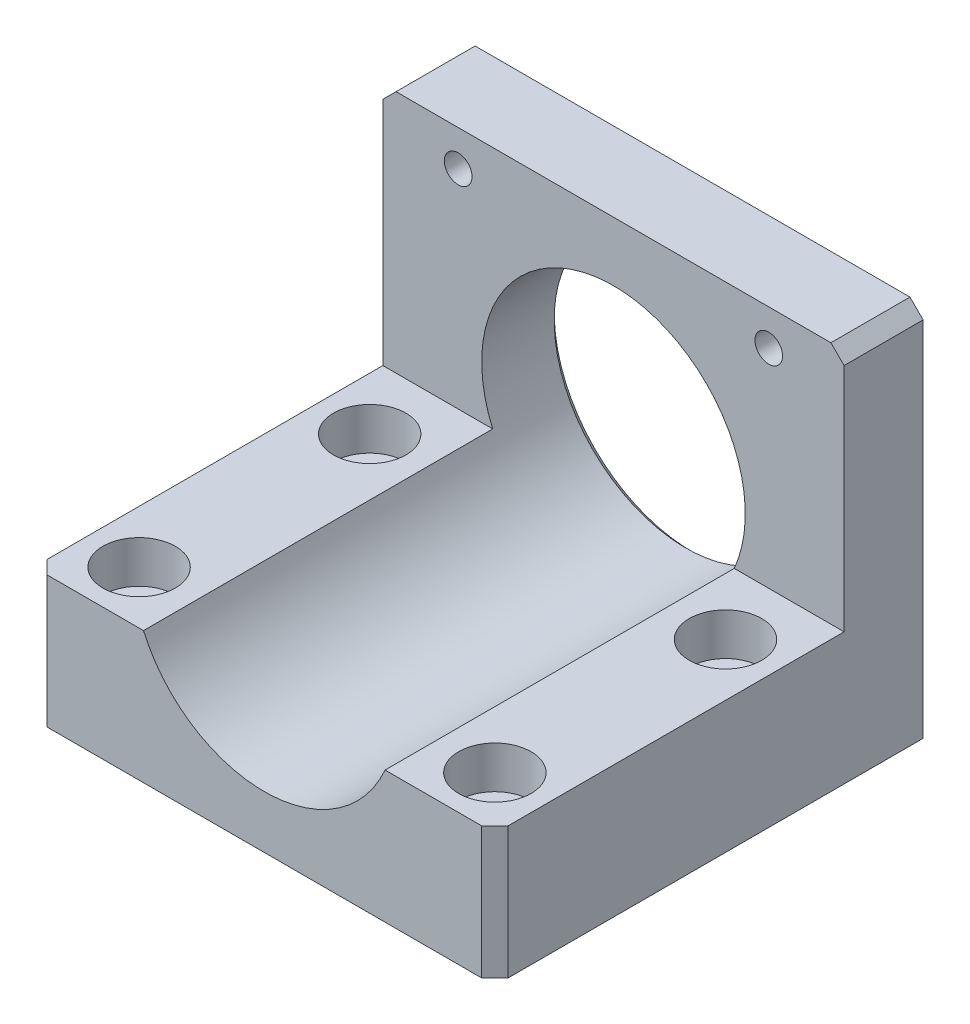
ISO-10303-21;
HEADER;
FILE_DESCRIPTION(('STEP AP214'),'2;1');
FILE_NAME('part.step','',(''),(''),'','','');
FILE_SCHEMA(('AUTOMOTIVE_DESIGN { 1 0 10303 214 1 1 1 1 }'));
ENDSEC;
DATA;
#1=APPLICATION_CONTEXT('core data for automotive mechanical design processes');
#2=APPLICATION_PROTOCOL_DEFINITION('international standard','automotive_design',2000,#1);
#3=PRODUCT_CONTEXT('',#1,'mechanical');
#4=PRODUCT('Part','Part','',(#3));
#5=PRODUCT_RELATED_PRODUCT_CATEGORY('part','',(#4));
#6=PRODUCT_DEFINITION_FORMATION('','',#4);
#7=PRODUCT_DEFINITION_CONTEXT('part definition',#1,'design');
#8=PRODUCT_DEFINITION('design','',#6,#7);
#9=PRODUCT_DEFINITION_SHAPE('','',#8);
#10=(LENGTH_UNIT() NAMED_UNIT(*) SI_UNIT(.MILLI.,.METRE.));
#11=(NAMED_UNIT(*) PLANE_ANGLE_UNIT() SI_UNIT($,.RADIAN.));
#12=(NAMED_UNIT(*) SI_UNIT($,.STERADIAN.) SOLID_ANGLE_UNIT());
#13=UNCERTAINTY_MEASURE_WITH_UNIT(LENGTH_MEASURE(1.E-05),#10,'distance_accuracy_value','');
#14=(GEOMETRIC_REPRESENTATION_CONTEXT(3) GLOBAL_UNCERTAINTY_ASSIGNED_CONTEXT((#13)) GLOBAL_UNIT_ASSIGNED_CONTEXT((#10,
#11,#12)) REPRESENTATION_CONTEXT('',''));
#15=CARTESIAN_POINT('',(0.,0.,0.));
#16=DIRECTION('',(0.,0.,1.));
#17=DIRECTION('',(1.,0.,0.));
#18=AXIS2_PLACEMENT_3D('',#15,#16,#17);
#19=CARTESIAN_POINT('',(0.,0.,65.));
#20=DIRECTION('',(0.,0.,1.));
#21=DIRECTION('',(1.,0.,0.));
#22=AXIS2_PLACEMENT_3D('',#19,#20,#21);
#23=PLANE('',#22);
#24=DIRECTION('',(1.,0.,0.));
#25=VECTOR('',#24,1.);
#26=CARTESIAN_POINT('',(-35.,-28.,65.));
#27=LINE('',#26,#25);
#28=CARTESIAN_POINT('',(-33.,-28.,65.));
#29=VERTEX_POINT('',#28);
#30=CARTESIAN_POINT('',(33.,-28.,65.));
#31=VERTEX_POINT('',#30);
#32=EDGE_CURVE('E236',#29,#31,#27,.T.);
#33=ORIENTED_EDGE('',*,*,#32,.T.);
#34=DIRECTION('',(0.,1.,0.));
#35=VECTOR('',#34,1.);
#36=CARTESIAN_POINT('',(33.,-8.00000000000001,65.));
#37=LINE('',#36,#35);
#38=CARTESIAN_POINT('',(33.,-8.00000000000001,65.));
#39=VERTEX_POINT('',#38);
#40=EDGE_CURVE('E261',#31,#39,#37,.T.);
#41=ORIENTED_EDGE('',*,*,#40,.T.);
#42=DIRECTION('',(1.,0.,0.));
#43=VECTOR('',#42,1.);
#44=CARTESIAN_POINT('',(-35.,-8.00000000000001,65.));
#45=LINE('',#44,#43);
#46=CARTESIAN_POINT('',(18.3303027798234,-8.00000000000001,65.));
#47=VERTEX_POINT('',#46);
#48=EDGE_CURVE('E208',#47,#39,#45,.T.);
#49=ORIENTED_EDGE('',*,*,#48,.F.);
#50=CARTESIAN_POINT('',(0.,0.,65.));
#51=DIRECTION('',(0.,0.,1.));
#52=DIRECTION('',(1.,0.,0.));
#53=AXIS2_PLACEMENT_3D('',#50,#51,#52);
#54=CIRCLE('',#53,20.);
#55=CARTESIAN_POINT('',(-18.3303027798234,-8.00000000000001,65.));
#56=VERTEX_POINT('',#55);
#57=EDGE_CURVE('E232',#56,#47,#54,.T.);
#58=ORIENTED_EDGE('',*,*,#57,.F.);
#59=CARTESIAN_POINT('',(-33.,-8.00000000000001,65.));
#60=VERTEX_POINT('',#59);
#61=EDGE_CURVE('E188',#60,#56,#45,.T.);
#62=ORIENTED_EDGE('',*,*,#61,.F.);
#63=DIRECTION('',(0.,-1.,0.));
#64=VECTOR('',#63,1.);
#65=CARTESIAN_POINT('',(-33.,-28.,65.));
#66=LINE('',#65,#64);
#67=EDGE_CURVE('E258',#60,#29,#66,.T.);
#68=ORIENTED_EDGE('',*,*,#67,.T.);
#69=EDGE_LOOP('',(#33,#41,#49,#58,#62,#68));
#70=FACE_BOUND('',#69,.T.);
#71=ADVANCED_FACE('F72',(#70),#23,.T.);
#72=CARTESIAN_POINT('',(0.,0.,0.));
#73=DIRECTION('',(0.,0.,1.));
#74=DIRECTION('',(1.,0.,0.));
#75=AXIS2_PLACEMENT_3D('',#72,#73,#74);
#76=PLANE('',#75);
#77=CARTESIAN_POINT('',(0.,0.,0.));
#78=DIRECTION('',(0.,0.,1.));
#79=DIRECTION('',(1.,0.,0.));
#80=AXIS2_PLACEMENT_3D('',#77,#78,#79);
#81=CIRCLE('',#80,21.);
#82=CARTESIAN_POINT('',(21.,0.,0.));
#83=VERTEX_POINT('',#82);
#84=EDGE_CURVE('E80',#83,#83,#81,.T.);
#85=ORIENTED_EDGE('',*,*,#84,.T.);
#86=EDGE_LOOP('',(#85));
#87=FACE_BOUND('',#86,.T.);
#88=CARTESIAN_POINT('',(23.57,23.57,0.));
#89=DIRECTION('',(0.,0.,-1.));
#90=DIRECTION('',(-1.,0.,0.));
#91=AXIS2_PLACEMENT_3D('',#88,#89,#90);
#92=CIRCLE('',#91,2.09999999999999);
#93=CARTESIAN_POINT('',(21.47,23.57,0.));
#94=VERTEX_POINT('',#93);
#95=EDGE_CURVE('E214',#94,#94,#92,.T.);
#96=ORIENTED_EDGE('',*,*,#95,.F.);
#97=EDGE_LOOP('',(#96));
#98=FACE_BOUND('',#97,.T.);
#99=CARTESIAN_POINT('',(-23.57,23.57,0.));
#100=DIRECTION('',(0.,0.,-1.));
#101=DIRECTION('',(-1.,0.,0.));
#102=AXIS2_PLACEMENT_3D('',#99,#100,#101);
#103=CIRCLE('',#102,2.09999999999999);
#104=CARTESIAN_POINT('',(-25.67,23.57,0.));
#105=VERTEX_POINT('',#104);
#106=EDGE_CURVE('E217',#105,#105,#103,.T.);
#107=ORIENTED_EDGE('',*,*,#106,.F.);
#108=EDGE_LOOP('',(#107));
#109=FACE_BOUND('',#108,.T.);
#110=CARTESIAN_POINT('',(-23.57,-23.57,0.));
#111=DIRECTION('',(0.,0.,-1.));
#112=DIRECTION('',(-1.,0.,0.));
#113=AXIS2_PLACEMENT_3D('',#110,#111,#112);
#114=CIRCLE('',#113,2.09999999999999);
#115=CARTESIAN_POINT('',(-25.67,-23.57,0.));
#116=VERTEX_POINT('',#115);
#117=EDGE_CURVE('E220',#116,#116,#114,.T.);
#118=ORIENTED_EDGE('',*,*,#117,.F.);
#119=EDGE_LOOP('',(#118));
#120=FACE_BOUND('',#119,.T.);
#121=CARTESIAN_POINT('',(23.57,-23.57,0.));
#122=DIRECTION('',(0.,0.,-1.));
#123=DIRECTION('',(-1.,0.,0.));
#124=AXIS2_PLACEMENT_3D('',#121,#122,#123);
#125=CIRCLE('',#124,2.09999999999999);
#126=CARTESIAN_POINT('',(21.47,-23.57,0.));
#127=VERTEX_POINT('',#126);
#128=EDGE_CURVE('E226',#127,#127,#125,.T.);
#129=ORIENTED_EDGE('',*,*,#128,.F.);
#130=EDGE_LOOP('',(#129));
#131=FACE_BOUND('',#130,.T.);
#132=DIRECTION('',(0.,-1.,0.));
#133=VECTOR('',#132,1.);
#134=CARTESIAN_POINT('',(-35.,29.,0.));
#135=LINE('',#134,#133);
#136=CARTESIAN_POINT('',(-35.,27.,0.));
#137=VERTEX_POINT('',#136);
#138=CARTESIAN_POINT('',(-35.,-28.,0.));
#139=VERTEX_POINT('',#138);
#140=EDGE_CURVE('E235',#137,#139,#135,.T.);
#141=ORIENTED_EDGE('',*,*,#140,.F.);
#142=DIRECTION('',(-0.707106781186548,-0.707106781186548,0.));
#143=VECTOR('',#142,1.);
#144=CARTESIAN_POINT('',(-35.,27.,0.));
#145=LINE('',#144,#143);
#146=CARTESIAN_POINT('',(-33.,29.,0.));
#147=VERTEX_POINT('',#146);
#148=EDGE_CURVE('E281',#137,#147,#145,.F.);
#149=ORIENTED_EDGE('',*,*,#148,.T.);
#150=DIRECTION('',(-1.,0.,0.));
#151=VECTOR('',#150,1.);
#152=CARTESIAN_POINT('',(-35.,29.,0.));
#153=LINE('',#152,#151);
#154=CARTESIAN_POINT('',(33.,29.,0.));
#155=VERTEX_POINT('',#154);
#156=EDGE_CURVE('E240',#155,#147,#153,.T.);
#157=ORIENTED_EDGE('',*,*,#156,.F.);
#158=DIRECTION('',(-0.707106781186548,0.707106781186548,0.));
#159=VECTOR('',#158,1.);
#160=CARTESIAN_POINT('',(33.,29.,0.));
#161=LINE('',#160,#159);
#162=CARTESIAN_POINT('',(35.,27.,0.));
#163=VERTEX_POINT('',#162);
#164=EDGE_CURVE('E279',#155,#163,#161,.F.);
#165=ORIENTED_EDGE('',*,*,#164,.T.);
#166=DIRECTION('',(0.,1.,0.));
#167=VECTOR('',#166,1.);
#168=CARTESIAN_POINT('',(35.,29.,0.));
#169=LINE('',#168,#167);
#170=CARTESIAN_POINT('',(35.,-28.,0.));
#171=VERTEX_POINT('',#170);
#172=EDGE_CURVE('E245',#171,#163,#169,.T.);
#173=ORIENTED_EDGE('',*,*,#172,.F.);
#174=DIRECTION('',(1.,0.,0.));
#175=VECTOR('',#174,1.);
#176=CARTESIAN_POINT('',(-35.,-28.,0.));
#177=LINE('',#176,#175);
#178=EDGE_CURVE('E242',#139,#171,#177,.T.);
#179=ORIENTED_EDGE('',*,*,#178,.F.);
#180=EDGE_LOOP('',(#141,#149,#157,#165,#173,#179));
#181=FACE_BOUND('',#180,.T.);
#182=ADVANCED_FACE('F292',(#87,#98,#109,#120,#131,#181),#76,.F.);
#183=CARTESIAN_POINT('',(-35.,29.,65.));
#184=DIRECTION('',(1.,0.,0.));
#185=DIRECTION('',(0.,1.,0.));
#186=AXIS2_PLACEMENT_3D('',#183,#184,#185);
#187=PLANE('',#186);
#188=DIRECTION('',(0.,0.,-1.));
#189=VECTOR('',#188,1.);
#190=CARTESIAN_POINT('',(-35.,-28.,65.));
#191=LINE('',#190,#189);
#192=CARTESIAN_POINT('',(-35.,-28.,63.));
#193=VERTEX_POINT('',#192);
#194=EDGE_CURVE('E249',#193,#139,#191,.T.);
#195=ORIENTED_EDGE('',*,*,#194,.F.);
#196=DIRECTION('',(0.,1.,0.));
#197=VECTOR('',#196,1.);
#198=CARTESIAN_POINT('',(-35.,-8.00000000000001,63.));
#199=LINE('',#198,#197);
#200=CARTESIAN_POINT('',(-35.,-8.00000000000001,63.));
#201=VERTEX_POINT('',#200);
#202=EDGE_CURVE('E275',#193,#201,#199,.T.);
#203=ORIENTED_EDGE('',*,*,#202,.T.);
#204=DIRECTION('',(0.,0.,-1.));
#205=VECTOR('',#204,1.);
#206=CARTESIAN_POINT('',(-35.,-8.,12.));
#207=LINE('',#206,#205);
#208=CARTESIAN_POINT('',(-35.,-8.,12.));
#209=VERTEX_POINT('',#208);
#210=EDGE_CURVE('E203',#201,#209,#207,.T.);
#211=ORIENTED_EDGE('',*,*,#210,.T.);
#212=DIRECTION('',(0.,1.,0.));
#213=VECTOR('',#212,1.);
#214=CARTESIAN_POINT('',(-35.,29.,12.));
#215=LINE('',#214,#213);
#216=CARTESIAN_POINT('',(-35.,27.,12.));
#217=VERTEX_POINT('',#216);
#218=EDGE_CURVE('E178',#209,#217,#215,.T.);
#219=ORIENTED_EDGE('',*,*,#218,.T.);
#220=DIRECTION('',(0.,0.,-1.));
#221=VECTOR('',#220,1.);
#222=CARTESIAN_POINT('',(-35.,27.,65.));
#223=LINE('',#222,#221);
#224=EDGE_CURVE('E272',#217,#137,#223,.T.);
#225=ORIENTED_EDGE('',*,*,#224,.T.);
#226=ORIENTED_EDGE('',*,*,#140,.T.);
#227=EDGE_LOOP('',(#195,#203,#211,#219,#225,#226));
#228=FACE_BOUND('',#227,.T.);
#229=ADVANCED_FACE('F311',(#228),#187,.F.);
#230=CARTESIAN_POINT('',(-35.,-28.,65.));
#231=DIRECTION('',(0.,1.,0.));
#232=DIRECTION('',(-1.,0.,0.));
#233=AXIS2_PLACEMENT_3D('',#230,#231,#232);
#234=PLANE('',#233);
#235=CARTESIAN_POINT('',(-27.,-28.,22.));
#236=DIRECTION('',(0.,1.,0.));
#237=DIRECTION('',(0.,0.,1.));
#238=AXIS2_PLACEMENT_3D('',#235,#236,#237);
#239=CIRCLE('',#238,3.2);
#240=CARTESIAN_POINT('',(-27.,-28.,25.2));
#241=VERTEX_POINT('',#240);
#242=EDGE_CURVE('E467',#241,#241,#239,.T.);
#243=ORIENTED_EDGE('',*,*,#242,.T.);
#244=EDGE_LOOP('',(#243));
#245=FACE_BOUND('',#244,.T.);
#246=CARTESIAN_POINT('',(-27.,-28.,57.));
#247=DIRECTION('',(0.,1.,0.));
#248=DIRECTION('',(0.,0.,1.));
#249=AXIS2_PLACEMENT_3D('',#246,#247,#248);
#250=CIRCLE('',#249,3.2);
#251=CARTESIAN_POINT('',(-27.,-28.,60.2));
#252=VERTEX_POINT('',#251);
#253=EDGE_CURVE('E479',#252,#252,#250,.T.);
#254=ORIENTED_EDGE('',*,*,#253,.T.);
#255=EDGE_LOOP('',(#254));
#256=FACE_BOUND('',#255,.T.);
#257=CARTESIAN_POINT('',(27.,-28.,57.));
#258=DIRECTION('',(0.,1.,0.));
#259=DIRECTION('',(0.,0.,1.));
#260=AXIS2_PLACEMENT_3D('',#257,#258,#259);
#261=CIRCLE('',#260,3.2);
#262=CARTESIAN_POINT('',(27.,-28.,60.2));
#263=VERTEX_POINT('',#262);
#264=EDGE_CURVE('E491',#263,#263,#261,.T.);
#265=ORIENTED_EDGE('',*,*,#264,.T.);
#266=EDGE_LOOP('',(#265));
#267=FACE_BOUND('',#266,.T.);
#268=CARTESIAN_POINT('',(27.,-28.,22.));
#269=DIRECTION('',(0.,1.,0.));
#270=DIRECTION('',(0.,0.,1.));
#271=AXIS2_PLACEMENT_3D('',#268,#269,#270);
#272=CIRCLE('',#271,3.2);
#273=CARTESIAN_POINT('',(27.,-28.,25.2));
#274=VERTEX_POINT('',#273);
#275=EDGE_CURVE('E194',#274,#274,#272,.T.);
#276=ORIENTED_EDGE('',*,*,#275,.T.);
#277=EDGE_LOOP('',(#276));
#278=FACE_BOUND('',#277,.T.);
#279=DIRECTION('',(0.,0.,-1.));
#280=VECTOR('',#279,1.);
#281=CARTESIAN_POINT('',(35.,-28.,65.));
#282=LINE('',#281,#280);
#283=CARTESIAN_POINT('',(35.,-28.,63.));
#284=VERTEX_POINT('',#283);
#285=EDGE_CURVE('E239',#284,#171,#282,.T.);
#286=ORIENTED_EDGE('',*,*,#285,.F.);
#287=DIRECTION('',(-0.707106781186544,0.,0.707106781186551));
#288=VECTOR('',#287,1.);
#289=CARTESIAN_POINT('',(33.,-28.,65.));
#290=LINE('',#289,#288);
#291=EDGE_CURVE('E270',#284,#31,#290,.T.);
#292=ORIENTED_EDGE('',*,*,#291,.T.);
#293=ORIENTED_EDGE('',*,*,#32,.F.);
#294=DIRECTION('',(-0.707106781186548,0.,-0.707106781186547));
#295=VECTOR('',#294,1.);
#296=CARTESIAN_POINT('',(-33.,-28.,65.));
#297=LINE('',#296,#295);
#298=EDGE_CURVE('E268',#29,#193,#297,.T.);
#299=ORIENTED_EDGE('',*,*,#298,.T.);
#300=ORIENTED_EDGE('',*,*,#194,.T.);
#301=ORIENTED_EDGE('',*,*,#178,.T.);
#302=EDGE_LOOP('',(#286,#292,#293,#299,#300,#301));
#303=FACE_BOUND('',#302,.T.);
#304=ADVANCED_FACE('F322',(#245,#256,#267,#278,#303),#234,.F.);
#305=CARTESIAN_POINT('',(35.,29.,65.));
#306=DIRECTION('',(-1.,0.,0.));
#307=DIRECTION('',(0.,-1.,0.));
#308=AXIS2_PLACEMENT_3D('',#305,#306,#307);
#309=PLANE('',#308);
#310=DIRECTION('',(0.,0.,-1.));
#311=VECTOR('',#310,1.);
#312=CARTESIAN_POINT('',(35.,-8.,12.));
#313=LINE('',#312,#311);
#314=CARTESIAN_POINT('',(35.,-8.00000000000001,63.));
#315=VERTEX_POINT('',#314);
#316=CARTESIAN_POINT('',(35.,-8.,12.));
#317=VERTEX_POINT('',#316);
#318=EDGE_CURVE('E168',#315,#317,#313,.T.);
#319=ORIENTED_EDGE('',*,*,#318,.F.);
#320=DIRECTION('',(0.,-1.,0.));
#321=VECTOR('',#320,1.);
#322=CARTESIAN_POINT('',(35.,-28.,63.));
#323=LINE('',#322,#321);
#324=EDGE_CURVE('E266',#315,#284,#323,.T.);
#325=ORIENTED_EDGE('',*,*,#324,.T.);
#326=ORIENTED_EDGE('',*,*,#285,.T.);
#327=ORIENTED_EDGE('',*,*,#172,.T.);
#328=DIRECTION('',(0.,0.,1.));
#329=VECTOR('',#328,1.);
#330=CARTESIAN_POINT('',(35.,27.,65.));
#331=LINE('',#330,#329);
#332=CARTESIAN_POINT('',(35.,27.,12.));
#333=VERTEX_POINT('',#332);
#334=EDGE_CURVE('E193',#163,#333,#331,.T.);
#335=ORIENTED_EDGE('',*,*,#334,.T.);
#336=DIRECTION('',(0.,1.,0.));
#337=VECTOR('',#336,1.);
#338=CARTESIAN_POINT('',(35.,29.,12.));
#339=LINE('',#338,#337);
#340=EDGE_CURVE('E179',#317,#333,#339,.T.);
#341=ORIENTED_EDGE('',*,*,#340,.F.);
#342=EDGE_LOOP('',(#319,#325,#326,#327,#335,#341));
#343=FACE_BOUND('',#342,.T.);
#344=ADVANCED_FACE('F190',(#343),#309,.F.);
#345=CARTESIAN_POINT('',(-35.,29.,65.));
#346=DIRECTION('',(0.,-1.,0.));
#347=DIRECTION('',(1.,0.,0.));
#348=AXIS2_PLACEMENT_3D('',#345,#346,#347);
#349=PLANE('',#348);
#350=ORIENTED_EDGE('',*,*,#156,.T.);
#351=DIRECTION('',(0.,0.,1.));
#352=VECTOR('',#351,1.);
#353=CARTESIAN_POINT('',(-33.,29.,65.));
#354=LINE('',#353,#352);
#355=CARTESIAN_POINT('',(-33.,29.,12.));
#356=VERTEX_POINT('',#355);
#357=EDGE_CURVE('E94',#147,#356,#354,.T.);
#358=ORIENTED_EDGE('',*,*,#357,.T.);
#359=DIRECTION('',(1.,0.,0.));
#360=VECTOR('',#359,1.);
#361=CARTESIAN_POINT('',(-35.,29.,12.));
#362=LINE('',#361,#360);
#363=CARTESIAN_POINT('',(33.,29.,12.));
#364=VERTEX_POINT('',#363);
#365=EDGE_CURVE('E204',#356,#364,#362,.T.);
#366=ORIENTED_EDGE('',*,*,#365,.T.);
#367=DIRECTION('',(0.,0.,-1.));
#368=VECTOR('',#367,1.);
#369=CARTESIAN_POINT('',(33.,29.,65.));
#370=LINE('',#369,#368);
#371=EDGE_CURVE('E283',#364,#155,#370,.T.);
#372=ORIENTED_EDGE('',*,*,#371,.T.);
#373=EDGE_LOOP('',(#350,#358,#366,#372));
#374=FACE_BOUND('',#373,.T.);
#375=ADVANCED_FACE('F317',(#374),#349,.F.);
#376=CARTESIAN_POINT('',(0.,0.,65.));
#377=DIRECTION('',(0.,0.,-1.));
#378=DIRECTION('',(-1.,0.,0.));
#379=AXIS2_PLACEMENT_3D('',#376,#377,#378);
#380=CYLINDRICAL_SURFACE('',#379,20.);
#381=CARTESIAN_POINT('',(0.,0.,0.999999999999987));
#382=DIRECTION('',(0.,0.,1.));
#383=DIRECTION('',(1.,0.,0.));
#384=AXIS2_PLACEMENT_3D('',#381,#382,#383);
#385=CIRCLE('',#384,20.);
#386=CARTESIAN_POINT('',(20.,0.,0.999999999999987));
#387=VERTEX_POINT('',#386);
#388=EDGE_CURVE('E14',#387,#387,#385,.F.);
#389=ORIENTED_EDGE('',*,*,#388,.T.);
#390=EDGE_LOOP('',(#389));
#391=FACE_BOUND('',#390,.T.);
#392=DIRECTION('',(0.,0.,-1.));
#393=VECTOR('',#392,1.);
#394=CARTESIAN_POINT('',(-18.3303027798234,-8.00000000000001,65.));
#395=LINE('',#394,#393);
#396=CARTESIAN_POINT('',(-18.3303027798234,-8.,12.));
#397=VERTEX_POINT('',#396);
#398=EDGE_CURVE('E256',#56,#397,#395,.T.);
#399=ORIENTED_EDGE('',*,*,#398,.F.);
#400=ORIENTED_EDGE('',*,*,#57,.T.);
#401=DIRECTION('',(0.,0.,-1.));
#402=VECTOR('',#401,1.);
#403=CARTESIAN_POINT('',(18.3303027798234,-8.00000000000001,65.));
#404=LINE('',#403,#402);
#405=CARTESIAN_POINT('',(18.3303027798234,-8.00000000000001,12.));
#406=VERTEX_POINT('',#405);
#407=EDGE_CURVE('E252',#406,#47,#404,.F.);
#408=ORIENTED_EDGE('',*,*,#407,.F.);
#409=CARTESIAN_POINT('',(0.,0.,12.));
#410=DIRECTION('',(0.,0.,-1.));
#411=DIRECTION('',(0.,1.,0.));
#412=AXIS2_PLACEMENT_3D('',#409,#410,#411);
#413=CIRCLE('',#412,20.);
#414=EDGE_CURVE('E185',#397,#406,#413,.T.);
#415=ORIENTED_EDGE('',*,*,#414,.F.);
#416=EDGE_LOOP('',(#399,#400,#408,#415));
#417=FACE_BOUND('',#416,.T.);
#418=ADVANCED_FACE('F314',(#391,#417),#380,.F.);
#419=CARTESIAN_POINT('',(23.57,-23.57,14.));
#420=DIRECTION('',(0.,0.,-1.));
#421=DIRECTION('',(-1.,0.,0.));
#422=AXIS2_PLACEMENT_3D('',#419,#420,#421);
#423=CONICAL_SURFACE('',#422,2.1,1.02974425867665);
#424=CARTESIAN_POINT('',(23.57,-23.57,15.2618072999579));
#425=VERTEX_POINT('',#424);
#426=VERTEX_LOOP('',#425);
#427=FACE_BOUND('',#426,.T.);
#428=CARTESIAN_POINT('',(23.57,-23.57,14.));
#429=DIRECTION('',(0.,0.,-1.));
#430=DIRECTION('',(-1.,0.,0.));
#431=AXIS2_PLACEMENT_3D('',#428,#429,#430);
#432=CIRCLE('',#431,2.1);
#433=CARTESIAN_POINT('',(21.47,-23.57,14.));
#434=VERTEX_POINT('',#433);
#435=EDGE_CURVE('E229',#434,#434,#432,.T.);
#436=ORIENTED_EDGE('',*,*,#435,.T.);
#437=EDGE_LOOP('',(#436));
#438=FACE_BOUND('',#437,.T.);
#439=ADVANCED_FACE('F370',(#427,#438),#423,.F.);
#440=CARTESIAN_POINT('',(23.57,-23.57,0.));
#441=DIRECTION('',(0.,0.,-1.));
#442=DIRECTION('',(-1.,0.,0.));
#443=AXIS2_PLACEMENT_3D('',#440,#441,#442);
#444=CYLINDRICAL_SURFACE('',#443,2.09999999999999);
#445=ORIENTED_EDGE('',*,*,#435,.F.);
#446=EDGE_LOOP('',(#445));
#447=FACE_BOUND('',#446,.T.);
#448=ORIENTED_EDGE('',*,*,#128,.T.);
#449=EDGE_LOOP('',(#448));
#450=FACE_BOUND('',#449,.T.);
#451=ADVANCED_FACE('F375',(#447,#450),#444,.F.);
#452=CARTESIAN_POINT('',(-23.57,-23.57,14.));
#453=DIRECTION('',(0.,0.,-1.));
#454=DIRECTION('',(-1.,0.,0.));
#455=AXIS2_PLACEMENT_3D('',#452,#453,#454);
#456=CONICAL_SURFACE('',#455,2.1,1.02974425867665);
#457=CARTESIAN_POINT('',(-23.57,-23.57,15.2618072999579));
#458=VERTEX_POINT('',#457);
#459=VERTEX_LOOP('',#458);
#460=FACE_BOUND('',#459,.T.);
#461=CARTESIAN_POINT('',(-23.57,-23.57,14.));
#462=DIRECTION('',(0.,0.,-1.));
#463=DIRECTION('',(-1.,0.,0.));
#464=AXIS2_PLACEMENT_3D('',#461,#462,#463);
#465=CIRCLE('',#464,2.1);
#466=CARTESIAN_POINT('',(-25.67,-23.57,14.));
#467=VERTEX_POINT('',#466);
#468=EDGE_CURVE('E223',#467,#467,#465,.T.);
#469=ORIENTED_EDGE('',*,*,#468,.T.);
#470=EDGE_LOOP('',(#469));
#471=FACE_BOUND('',#470,.T.);
#472=ADVANCED_FACE('F380',(#460,#471),#456,.F.);
#473=CARTESIAN_POINT('',(-23.57,-23.57,0.));
#474=DIRECTION('',(0.,0.,-1.));
#475=DIRECTION('',(-1.,0.,0.));
#476=AXIS2_PLACEMENT_3D('',#473,#474,#475);
#477=CYLINDRICAL_SURFACE('',#476,2.09999999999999);
#478=ORIENTED_EDGE('',*,*,#468,.F.);
#479=EDGE_LOOP('',(#478));
#480=FACE_BOUND('',#479,.T.);
#481=ORIENTED_EDGE('',*,*,#117,.T.);
#482=EDGE_LOOP('',(#481));
#483=FACE_BOUND('',#482,.T.);
#484=ADVANCED_FACE('F387',(#480,#483),#477,.F.);
#485=CARTESIAN_POINT('',(-23.57,23.57,0.));
#486=DIRECTION('',(0.,0.,-1.));
#487=DIRECTION('',(-1.,0.,0.));
#488=AXIS2_PLACEMENT_3D('',#485,#486,#487);
#489=CYLINDRICAL_SURFACE('',#488,2.09999999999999);
#490=CARTESIAN_POINT('',(-23.57,23.57,12.));
#491=DIRECTION('',(0.,0.,-1.));
#492=DIRECTION('',(0.,1.,0.));
#493=AXIS2_PLACEMENT_3D('',#490,#491,#492);
#494=CIRCLE('',#493,2.09999999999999);
#495=CARTESIAN_POINT('',(-23.57,25.67,12.));
#496=VERTEX_POINT('',#495);
#497=EDGE_CURVE('E210',#496,#496,#494,.F.);
#498=ORIENTED_EDGE('',*,*,#497,.T.);
#499=EDGE_LOOP('',(#498));
#500=FACE_BOUND('',#499,.T.);
#501=ORIENTED_EDGE('',*,*,#106,.T.);
#502=EDGE_LOOP('',(#501));
#503=FACE_BOUND('',#502,.T.);
#504=ADVANCED_FACE('F391',(#500,#503),#489,.F.);
#505=CARTESIAN_POINT('',(23.57,23.57,0.));
#506=DIRECTION('',(0.,0.,-1.));
#507=DIRECTION('',(-1.,0.,0.));
#508=AXIS2_PLACEMENT_3D('',#505,#506,#507);
#509=CYLINDRICAL_SURFACE('',#508,2.09999999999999);
#510=CARTESIAN_POINT('',(23.57,23.57,12.));
#511=DIRECTION('',(0.,0.,-1.));
#512=DIRECTION('',(0.,1.,0.));
#513=AXIS2_PLACEMENT_3D('',#510,#511,#512);
#514=CIRCLE('',#513,2.09999999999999);
#515=CARTESIAN_POINT('',(23.57,25.67,12.));
#516=VERTEX_POINT('',#515);
#517=EDGE_CURVE('E206',#516,#516,#514,.F.);
#518=ORIENTED_EDGE('',*,*,#517,.T.);
#519=EDGE_LOOP('',(#518));
#520=FACE_BOUND('',#519,.T.);
#521=ORIENTED_EDGE('',*,*,#95,.T.);
#522=EDGE_LOOP('',(#521));
#523=FACE_BOUND('',#522,.T.);
#524=ADVANCED_FACE('F395',(#520,#523),#509,.F.);
#525=CARTESIAN_POINT('',(-35.,-8.,12.));
#526=DIRECTION('',(0.,-1.,0.));
#527=DIRECTION('',(0.,0.,-1.));
#528=AXIS2_PLACEMENT_3D('',#525,#526,#527);
#529=PLANE('',#528);
#530=CARTESIAN_POINT('',(-27.,-8.,22.));
#531=DIRECTION('',(0.,1.,0.));
#532=DIRECTION('',(0.,0.,1.));
#533=AXIS2_PLACEMENT_3D('',#530,#531,#532);
#534=CIRCLE('',#533,5.5);
#535=CARTESIAN_POINT('',(-27.,-8.,27.5));
#536=VERTEX_POINT('',#535);
#537=EDGE_CURVE('E459',#536,#536,#534,.T.);
#538=ORIENTED_EDGE('',*,*,#537,.F.);
#539=EDGE_LOOP('',(#538));
#540=FACE_BOUND('',#539,.T.);
#541=CARTESIAN_POINT('',(-27.,-8.,57.));
#542=DIRECTION('',(0.,1.,0.));
#543=DIRECTION('',(0.,0.,1.));
#544=AXIS2_PLACEMENT_3D('',#541,#542,#543);
#545=CIRCLE('',#544,5.5);
#546=CARTESIAN_POINT('',(-27.,-8.,62.5));
#547=VERTEX_POINT('',#546);
#548=EDGE_CURVE('E470',#547,#547,#545,.T.);
#549=ORIENTED_EDGE('',*,*,#548,.F.);
#550=EDGE_LOOP('',(#549));
#551=FACE_BOUND('',#550,.T.);
#552=ORIENTED_EDGE('',*,*,#210,.F.);
#553=DIRECTION('',(0.707106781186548,0.,0.707106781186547));
#554=VECTOR('',#553,1.);
#555=CARTESIAN_POINT('',(-33.,-8.00000000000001,65.));
#556=LINE('',#555,#554);
#557=EDGE_CURVE('E277',#201,#60,#556,.T.);
#558=ORIENTED_EDGE('',*,*,#557,.T.);
#559=ORIENTED_EDGE('',*,*,#61,.T.);
#560=ORIENTED_EDGE('',*,*,#398,.T.);
#561=DIRECTION('',(1.,0.,0.));
#562=VECTOR('',#561,1.);
#563=CARTESIAN_POINT('',(-35.,-8.,12.));
#564=LINE('',#563,#562);
#565=EDGE_CURVE('E187',#209,#397,#564,.T.);
#566=ORIENTED_EDGE('',*,*,#565,.F.);
#567=EDGE_LOOP('',(#552,#558,#559,#560,#566));
#568=FACE_BOUND('',#567,.T.);
#569=ADVANCED_FACE('F352',(#540,#551,#568),#529,.F.);
#570=CARTESIAN_POINT('',(-35.,29.,12.));
#571=DIRECTION('',(0.,0.,-1.));
#572=DIRECTION('',(0.,1.,0.));
#573=AXIS2_PLACEMENT_3D('',#570,#571,#572);
#574=PLANE('',#573);
#575=ORIENTED_EDGE('',*,*,#365,.F.);
#576=DIRECTION('',(0.707106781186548,0.707106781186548,0.));
#577=VECTOR('',#576,1.);
#578=CARTESIAN_POINT('',(-35.,27.,12.));
#579=LINE('',#578,#577);
#580=EDGE_CURVE('E288',#356,#217,#579,.F.);
#581=ORIENTED_EDGE('',*,*,#580,.T.);
#582=ORIENTED_EDGE('',*,*,#218,.F.);
#583=ORIENTED_EDGE('',*,*,#565,.T.);
#584=ORIENTED_EDGE('',*,*,#414,.T.);
#585=EDGE_CURVE('E172',#406,#317,#564,.T.);
#586=ORIENTED_EDGE('',*,*,#585,.T.);
#587=ORIENTED_EDGE('',*,*,#340,.T.);
#588=DIRECTION('',(0.707106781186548,-0.707106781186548,0.));
#589=VECTOR('',#588,1.);
#590=CARTESIAN_POINT('',(33.,29.,12.));
#591=LINE('',#590,#589);
#592=EDGE_CURVE('E87',#333,#364,#591,.F.);
#593=ORIENTED_EDGE('',*,*,#592,.T.);
#594=EDGE_LOOP('',(#575,#581,#582,#583,#584,#586,#587,#593));
#595=FACE_BOUND('',#594,.T.);
#596=ORIENTED_EDGE('',*,*,#517,.F.);
#597=EDGE_LOOP('',(#596));
#598=FACE_BOUND('',#597,.T.);
#599=ORIENTED_EDGE('',*,*,#497,.F.);
#600=EDGE_LOOP('',(#599));
#601=FACE_BOUND('',#600,.T.);
#602=ADVANCED_FACE('F181',(#595,#598,#601),#574,.F.);
#603=CARTESIAN_POINT('',(27.,-8.,57.));
#604=DIRECTION('',(0.,1.,0.));
#605=DIRECTION('',(0.,0.,1.));
#606=AXIS2_PLACEMENT_3D('',#603,#604,#605);
#607=CIRCLE('',#606,5.5);
#608=CARTESIAN_POINT('',(27.,-8.,62.5));
#609=VERTEX_POINT('',#608);
#610=EDGE_CURVE('E482',#609,#609,#607,.T.);
#611=ORIENTED_EDGE('',*,*,#610,.F.);
#612=EDGE_LOOP('',(#611));
#613=FACE_BOUND('',#612,.T.);
#614=CARTESIAN_POINT('',(27.,-8.,22.));
#615=DIRECTION('',(0.,1.,0.));
#616=DIRECTION('',(0.,0.,1.));
#617=AXIS2_PLACEMENT_3D('',#614,#615,#616);
#618=CIRCLE('',#617,5.5);
#619=CARTESIAN_POINT('',(27.,-8.,27.5));
#620=VERTEX_POINT('',#619);
#621=EDGE_CURVE('E494',#620,#620,#618,.T.);
#622=ORIENTED_EDGE('',*,*,#621,.F.);
#623=EDGE_LOOP('',(#622));
#624=FACE_BOUND('',#623,.T.);
#625=ORIENTED_EDGE('',*,*,#48,.T.);
#626=DIRECTION('',(0.707106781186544,0.,-0.707106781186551));
#627=VECTOR('',#626,1.);
#628=CARTESIAN_POINT('',(33.,-8.00000000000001,65.));
#629=LINE('',#628,#627);
#630=EDGE_CURVE('E174',#39,#315,#629,.T.);
#631=ORIENTED_EDGE('',*,*,#630,.T.);
#632=ORIENTED_EDGE('',*,*,#318,.T.);
#633=ORIENTED_EDGE('',*,*,#585,.F.);
#634=ORIENTED_EDGE('',*,*,#407,.T.);
#635=EDGE_LOOP('',(#625,#631,#632,#633,#634));
#636=FACE_BOUND('',#635,.T.);
#637=ADVANCED_FACE('F171',(#613,#624,#636),#529,.F.);
#638=CARTESIAN_POINT('',(27.,-8.,22.));
#639=DIRECTION('',(0.,1.,0.));
#640=DIRECTION('',(0.,0.,1.));
#641=AXIS2_PLACEMENT_3D('',#638,#639,#640);
#642=CYLINDRICAL_SURFACE('',#641,3.2);
#643=ORIENTED_EDGE('',*,*,#275,.F.);
#644=EDGE_LOOP('',(#643));
#645=FACE_BOUND('',#644,.T.);
#646=CARTESIAN_POINT('',(27.,-14.4,22.));
#647=DIRECTION('',(0.,1.,0.));
#648=DIRECTION('',(0.,0.,1.));
#649=AXIS2_PLACEMENT_3D('',#646,#647,#648);
#650=CIRCLE('',#649,3.2);
#651=CARTESIAN_POINT('',(27.,-14.4,25.2));
#652=VERTEX_POINT('',#651);
#653=EDGE_CURVE('E197',#652,#652,#650,.T.);
#654=ORIENTED_EDGE('',*,*,#653,.T.);
#655=EDGE_LOOP('',(#654));
#656=FACE_BOUND('',#655,.T.);
#657=ADVANCED_FACE('F404',(#645,#656),#642,.F.);
#658=CARTESIAN_POINT('',(30.2,-14.4,22.));
#659=DIRECTION('',(0.,-1.,0.));
#660=DIRECTION('',(0.,0.,-1.));
#661=AXIS2_PLACEMENT_3D('',#658,#659,#660);
#662=PLANE('',#661);
#663=ORIENTED_EDGE('',*,*,#653,.F.);
#664=EDGE_LOOP('',(#663));
#665=FACE_BOUND('',#664,.T.);
#666=CARTESIAN_POINT('',(27.,-14.4,22.));
#667=DIRECTION('',(0.,1.,0.));
#668=DIRECTION('',(0.,0.,1.));
#669=AXIS2_PLACEMENT_3D('',#666,#667,#668);
#670=CIRCLE('',#669,5.5);
#671=CARTESIAN_POINT('',(27.,-14.4,27.5));
#672=VERTEX_POINT('',#671);
#673=EDGE_CURVE('E497',#672,#672,#670,.T.);
#674=ORIENTED_EDGE('',*,*,#673,.T.);
#675=EDGE_LOOP('',(#674));
#676=FACE_BOUND('',#675,.T.);
#677=ADVANCED_FACE('F408',(#665,#676),#662,.F.);
#678=CARTESIAN_POINT('',(27.,-8.,22.));
#679=DIRECTION('',(0.,1.,0.));
#680=DIRECTION('',(0.,0.,1.));
#681=AXIS2_PLACEMENT_3D('',#678,#679,#680);
#682=CYLINDRICAL_SURFACE('',#681,5.5);
#683=ORIENTED_EDGE('',*,*,#673,.F.);
#684=EDGE_LOOP('',(#683));
#685=FACE_BOUND('',#684,.T.);
#686=ORIENTED_EDGE('',*,*,#621,.T.);
#687=EDGE_LOOP('',(#686));
#688=FACE_BOUND('',#687,.T.);
#689=ADVANCED_FACE('F412',(#685,#688),#682,.F.);
#690=CARTESIAN_POINT('',(27.,-8.,57.));
#691=DIRECTION('',(0.,1.,0.));
#692=DIRECTION('',(0.,0.,1.));
#693=AXIS2_PLACEMENT_3D('',#690,#691,#692);
#694=CYLINDRICAL_SURFACE('',#693,3.2);
#695=ORIENTED_EDGE('',*,*,#264,.F.);
#696=EDGE_LOOP('',(#695));
#697=FACE_BOUND('',#696,.T.);
#698=CARTESIAN_POINT('',(27.,-14.4,57.));
#699=DIRECTION('',(0.,1.,0.));
#700=DIRECTION('',(0.,0.,1.));
#701=AXIS2_PLACEMENT_3D('',#698,#699,#700);
#702=CIRCLE('',#701,3.2);
#703=CARTESIAN_POINT('',(27.,-14.4,60.2));
#704=VERTEX_POINT('',#703);
#705=EDGE_CURVE('E488',#704,#704,#702,.T.);
#706=ORIENTED_EDGE('',*,*,#705,.T.);
#707=EDGE_LOOP('',(#706));
#708=FACE_BOUND('',#707,.T.);
#709=ADVANCED_FACE('F416',(#697,#708),#694,.F.);
#710=CARTESIAN_POINT('',(30.2,-14.4,57.));
#711=DIRECTION('',(0.,-1.,0.));
#712=DIRECTION('',(0.,0.,-1.));
#713=AXIS2_PLACEMENT_3D('',#710,#711,#712);
#714=PLANE('',#713);
#715=ORIENTED_EDGE('',*,*,#705,.F.);
#716=EDGE_LOOP('',(#715));
#717=FACE_BOUND('',#716,.T.);
#718=CARTESIAN_POINT('',(27.,-14.4,57.));
#719=DIRECTION('',(0.,1.,0.));
#720=DIRECTION('',(0.,0.,1.));
#721=AXIS2_PLACEMENT_3D('',#718,#719,#720);
#722=CIRCLE('',#721,5.5);
#723=CARTESIAN_POINT('',(27.,-14.4,62.5));
#724=VERTEX_POINT('',#723);
#725=EDGE_CURVE('E485',#724,#724,#722,.T.);
#726=ORIENTED_EDGE('',*,*,#725,.T.);
#727=EDGE_LOOP('',(#726));
#728=FACE_BOUND('',#727,.T.);
#729=ADVANCED_FACE('F420',(#717,#728),#714,.F.);
#730=CARTESIAN_POINT('',(27.,-8.,57.));
#731=DIRECTION('',(0.,1.,0.));
#732=DIRECTION('',(0.,0.,1.));
#733=AXIS2_PLACEMENT_3D('',#730,#731,#732);
#734=CYLINDRICAL_SURFACE('',#733,5.5);
#735=ORIENTED_EDGE('',*,*,#725,.F.);
#736=EDGE_LOOP('',(#735));
#737=FACE_BOUND('',#736,.T.);
#738=ORIENTED_EDGE('',*,*,#610,.T.);
#739=EDGE_LOOP('',(#738));
#740=FACE_BOUND('',#739,.T.);
#741=ADVANCED_FACE('F424',(#737,#740),#734,.F.);
#742=CARTESIAN_POINT('',(-27.,-8.,57.));
#743=DIRECTION('',(0.,1.,0.));
#744=DIRECTION('',(0.,0.,1.));
#745=AXIS2_PLACEMENT_3D('',#742,#743,#744);
#746=CYLINDRICAL_SURFACE('',#745,3.2);
#747=ORIENTED_EDGE('',*,*,#253,.F.);
#748=EDGE_LOOP('',(#747));
#749=FACE_BOUND('',#748,.T.);
#750=CARTESIAN_POINT('',(-27.,-14.4,57.));
#751=DIRECTION('',(0.,1.,0.));
#752=DIRECTION('',(0.,0.,1.));
#753=AXIS2_PLACEMENT_3D('',#750,#751,#752);
#754=CIRCLE('',#753,3.2);
#755=CARTESIAN_POINT('',(-27.,-14.4,60.2));
#756=VERTEX_POINT('',#755);
#757=EDGE_CURVE('E476',#756,#756,#754,.T.);
#758=ORIENTED_EDGE('',*,*,#757,.T.);
#759=EDGE_LOOP('',(#758));
#760=FACE_BOUND('',#759,.T.);
#761=ADVANCED_FACE('F428',(#749,#760),#746,.F.);
#762=CARTESIAN_POINT('',(-23.8,-14.4,57.));
#763=DIRECTION('',(0.,-1.,0.));
#764=DIRECTION('',(0.,0.,-1.));
#765=AXIS2_PLACEMENT_3D('',#762,#763,#764);
#766=PLANE('',#765);
#767=ORIENTED_EDGE('',*,*,#757,.F.);
#768=EDGE_LOOP('',(#767));
#769=FACE_BOUND('',#768,.T.);
#770=CARTESIAN_POINT('',(-27.,-14.4,57.));
#771=DIRECTION('',(0.,1.,0.));
#772=DIRECTION('',(0.,0.,1.));
#773=AXIS2_PLACEMENT_3D('',#770,#771,#772);
#774=CIRCLE('',#773,5.5);
#775=CARTESIAN_POINT('',(-27.,-14.4,62.5));
#776=VERTEX_POINT('',#775);
#777=EDGE_CURVE('E473',#776,#776,#774,.T.);
#778=ORIENTED_EDGE('',*,*,#777,.T.);
#779=EDGE_LOOP('',(#778));
#780=FACE_BOUND('',#779,.T.);
#781=ADVANCED_FACE('F432',(#769,#780),#766,.F.);
#782=CARTESIAN_POINT('',(-27.,-8.,57.));
#783=DIRECTION('',(0.,1.,0.));
#784=DIRECTION('',(0.,0.,1.));
#785=AXIS2_PLACEMENT_3D('',#782,#783,#784);
#786=CYLINDRICAL_SURFACE('',#785,5.5);
#787=ORIENTED_EDGE('',*,*,#777,.F.);
#788=EDGE_LOOP('',(#787));
#789=FACE_BOUND('',#788,.T.);
#790=ORIENTED_EDGE('',*,*,#548,.T.);
#791=EDGE_LOOP('',(#790));
#792=FACE_BOUND('',#791,.T.);
#793=ADVANCED_FACE('F436',(#789,#792),#786,.F.);
#794=CARTESIAN_POINT('',(-27.,-8.,22.));
#795=DIRECTION('',(0.,1.,0.));
#796=DIRECTION('',(0.,0.,1.));
#797=AXIS2_PLACEMENT_3D('',#794,#795,#796);
#798=CYLINDRICAL_SURFACE('',#797,3.2);
#799=ORIENTED_EDGE('',*,*,#242,.F.);
#800=EDGE_LOOP('',(#799));
#801=FACE_BOUND('',#800,.T.);
#802=CARTESIAN_POINT('',(-27.,-14.4,22.));
#803=DIRECTION('',(0.,1.,0.));
#804=DIRECTION('',(0.,0.,1.));
#805=AXIS2_PLACEMENT_3D('',#802,#803,#804);
#806=CIRCLE('',#805,3.2);
#807=CARTESIAN_POINT('',(-27.,-14.4,25.2));
#808=VERTEX_POINT('',#807);
#809=EDGE_CURVE('E462',#808,#808,#806,.T.);
#810=ORIENTED_EDGE('',*,*,#809,.T.);
#811=EDGE_LOOP('',(#810));
#812=FACE_BOUND('',#811,.T.);
#813=ADVANCED_FACE('F440',(#801,#812),#798,.F.);
#814=CARTESIAN_POINT('',(-23.8,-14.4,22.));
#815=DIRECTION('',(0.,-1.,0.));
#816=DIRECTION('',(0.,0.,-1.));
#817=AXIS2_PLACEMENT_3D('',#814,#815,#816);
#818=PLANE('',#817);
#819=ORIENTED_EDGE('',*,*,#809,.F.);
#820=EDGE_LOOP('',(#819));
#821=FACE_BOUND('',#820,.T.);
#822=CARTESIAN_POINT('',(-27.,-14.4,22.));
#823=DIRECTION('',(0.,1.,0.));
#824=DIRECTION('',(0.,0.,1.));
#825=AXIS2_PLACEMENT_3D('',#822,#823,#824);
#826=CIRCLE('',#825,5.5);
#827=CARTESIAN_POINT('',(-27.,-14.4,27.5));
#828=VERTEX_POINT('',#827);
#829=EDGE_CURVE('E456',#828,#828,#826,.T.);
#830=ORIENTED_EDGE('',*,*,#829,.T.);
#831=EDGE_LOOP('',(#830));
#832=FACE_BOUND('',#831,.T.);
#833=ADVANCED_FACE('F444',(#821,#832),#818,.F.);
#834=CARTESIAN_POINT('',(-27.,-8.,22.));
#835=DIRECTION('',(0.,1.,0.));
#836=DIRECTION('',(0.,0.,1.));
#837=AXIS2_PLACEMENT_3D('',#834,#835,#836);
#838=CYLINDRICAL_SURFACE('',#837,5.5);
#839=ORIENTED_EDGE('',*,*,#829,.F.);
#840=EDGE_LOOP('',(#839));
#841=FACE_BOUND('',#840,.T.);
#842=ORIENTED_EDGE('',*,*,#537,.T.);
#843=EDGE_LOOP('',(#842));
#844=FACE_BOUND('',#843,.T.);
#845=ADVANCED_FACE('F333',(#841,#844),#838,.F.);
#846=CARTESIAN_POINT('',(33.,0.,65.));
#847=DIRECTION('',(0.707106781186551,0.,0.707106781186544));
#848=DIRECTION('',(0.,-1.,0.));
#849=AXIS2_PLACEMENT_3D('',#846,#847,#848);
#850=PLANE('',#849);
#851=ORIENTED_EDGE('',*,*,#291,.F.);
#852=ORIENTED_EDGE('',*,*,#324,.F.);
#853=ORIENTED_EDGE('',*,*,#630,.F.);
#854=ORIENTED_EDGE('',*,*,#40,.F.);
#855=EDGE_LOOP('',(#851,#852,#853,#854));
#856=FACE_BOUND('',#855,.T.);
#857=ADVANCED_FACE('F329',(#856),#850,.T.);
#858=CARTESIAN_POINT('',(-33.,0.,65.));
#859=DIRECTION('',(-0.707106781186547,0.,0.707106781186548));
#860=DIRECTION('',(0.,1.,0.));
#861=AXIS2_PLACEMENT_3D('',#858,#859,#860);
#862=PLANE('',#861);
#863=ORIENTED_EDGE('',*,*,#557,.F.);
#864=ORIENTED_EDGE('',*,*,#202,.F.);
#865=ORIENTED_EDGE('',*,*,#298,.F.);
#866=ORIENTED_EDGE('',*,*,#67,.F.);
#867=EDGE_LOOP('',(#863,#864,#865,#866));
#868=FACE_BOUND('',#867,.T.);
#869=ADVANCED_FACE('F332',(#868),#862,.T.);
#870=CARTESIAN_POINT('',(-35.,27.,65.));
#871=DIRECTION('',(0.707106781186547,-0.707106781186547,0.));
#872=DIRECTION('',(0.,0.,-1.));
#873=AXIS2_PLACEMENT_3D('',#870,#871,#872);
#874=PLANE('',#873);
#875=ORIENTED_EDGE('',*,*,#580,.F.);
#876=ORIENTED_EDGE('',*,*,#357,.F.);
#877=ORIENTED_EDGE('',*,*,#148,.F.);
#878=ORIENTED_EDGE('',*,*,#224,.F.);
#879=EDGE_LOOP('',(#875,#876,#877,#878));
#880=FACE_BOUND('',#879,.T.);
#881=ADVANCED_FACE('F301',(#880),#874,.F.);
#882=CARTESIAN_POINT('',(33.,29.,65.));
#883=DIRECTION('',(-0.707106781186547,-0.707106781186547,0.));
#884=DIRECTION('',(0.,0.,-1.));
#885=AXIS2_PLACEMENT_3D('',#882,#883,#884);
#886=PLANE('',#885);
#887=ORIENTED_EDGE('',*,*,#592,.F.);
#888=ORIENTED_EDGE('',*,*,#334,.F.);
#889=ORIENTED_EDGE('',*,*,#164,.F.);
#890=ORIENTED_EDGE('',*,*,#371,.F.);
#891=EDGE_LOOP('',(#887,#888,#889,#890));
#892=FACE_BOUND('',#891,.T.);
#893=ADVANCED_FACE('F296',(#892),#886,.F.);
#894=CARTESIAN_POINT('',(0.,0.,0.));
#895=DIRECTION('',(0.,0.,-1.));
#896=DIRECTION('',(-1.,0.,0.));
#897=AXIS2_PLACEMENT_3D('',#894,#895,#896);
#898=CONICAL_SURFACE('',#897,21.,0.785398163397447);
#899=ORIENTED_EDGE('',*,*,#388,.F.);
#900=EDGE_LOOP('',(#899));
#901=FACE_BOUND('',#900,.T.);
#902=ORIENTED_EDGE('',*,*,#84,.F.);
#903=EDGE_LOOP('',(#902));
#904=FACE_BOUND('',#903,.T.);
#905=ADVANCED_FACE('F74',(#901,#904),#898,.F.);
#906=CLOSED_SHELL('',(#71,#182,#229,#304,#344,#375,#418,#439,#451,#472,#484,#504,#524,#569,#602,
#637,#657,#677,#689,#709,#729,#741,#761,#781,#793,#813,#833,#845,#857,#869,#881,#893,#905));
#907=MANIFOLD_SOLID_BREP('B2',#906);
#908=ADVANCED_BREP_SHAPE_REPRESENTATION('',(#18,#907),#14);
#909=SHAPE_DEFINITION_REPRESENTATION(#9,#908);
ENDSEC;
END-ISO-10303-21;
